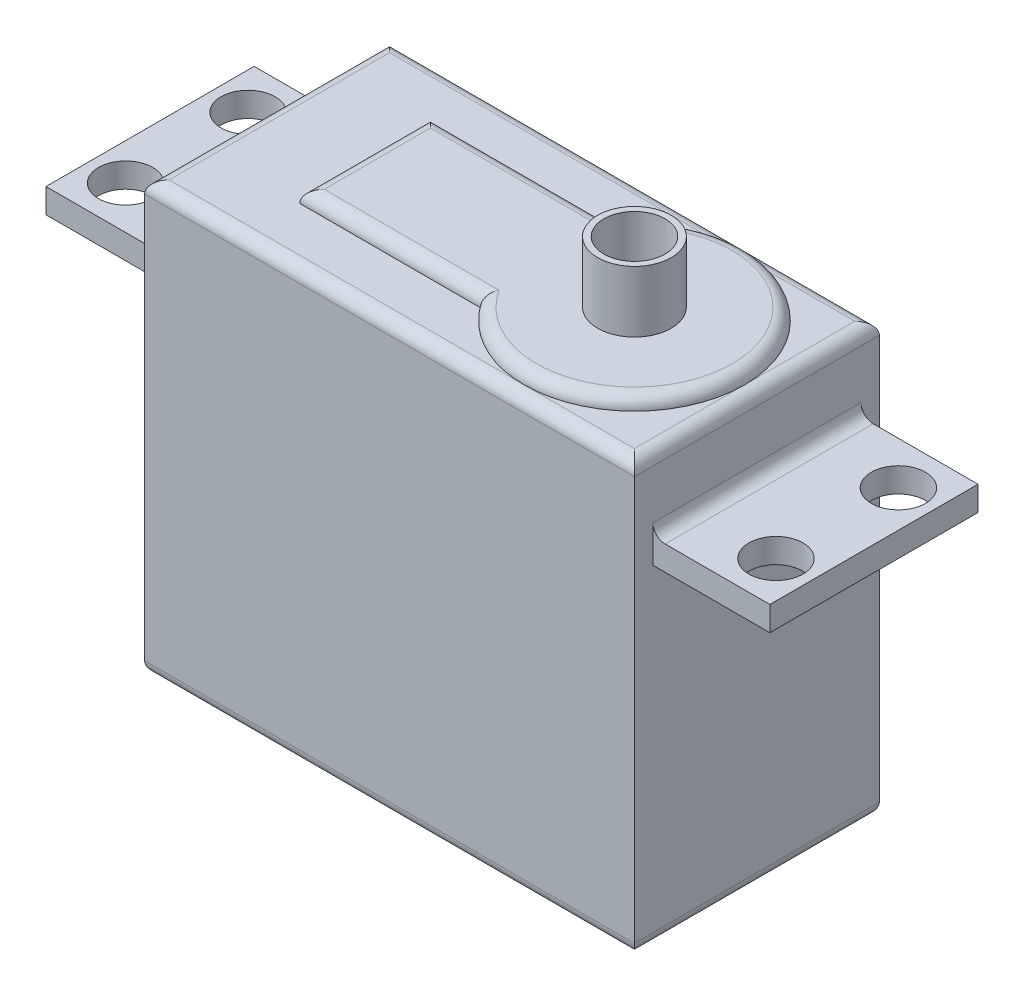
ISO-10303-21;
HEADER;
FILE_DESCRIPTION(('STEP AP214'),'2;1');
FILE_NAME('part.step','',(''),(''),'','','');
FILE_SCHEMA(('AUTOMOTIVE_DESIGN { 1 0 10303 214 1 1 1 1 }'));
ENDSEC;
DATA;
#1=APPLICATION_CONTEXT('core data for automotive mechanical design processes');
#2=APPLICATION_PROTOCOL_DEFINITION('international standard','automotive_design',2000,#1);
#3=PRODUCT_CONTEXT('',#1,'mechanical');
#4=PRODUCT('Part','Part','',(#3));
#5=PRODUCT_RELATED_PRODUCT_CATEGORY('part','',(#4));
#6=PRODUCT_DEFINITION_FORMATION('','',#4);
#7=PRODUCT_DEFINITION_CONTEXT('part definition',#1,'design');
#8=PRODUCT_DEFINITION('design','',#6,#7);
#9=PRODUCT_DEFINITION_SHAPE('','',#8);
#10=(LENGTH_UNIT() NAMED_UNIT(*) SI_UNIT(.MILLI.,.METRE.));
#11=(NAMED_UNIT(*) PLANE_ANGLE_UNIT() SI_UNIT($,.RADIAN.));
#12=(NAMED_UNIT(*) SI_UNIT($,.STERADIAN.) SOLID_ANGLE_UNIT());
#13=UNCERTAINTY_MEASURE_WITH_UNIT(LENGTH_MEASURE(1.E-05),#10,'distance_accuracy_value','');
#14=(GEOMETRIC_REPRESENTATION_CONTEXT(3) GLOBAL_UNCERTAINTY_ASSIGNED_CONTEXT((#13)) GLOBAL_UNIT_ASSIGNED_CONTEXT((#10,
#11,#12)) REPRESENTATION_CONTEXT('',''));
#15=CARTESIAN_POINT('',(0.,0.,0.));
#16=DIRECTION('',(0.,0.,1.));
#17=DIRECTION('',(1.,0.,0.));
#18=AXIS2_PLACEMENT_3D('',#15,#16,#17);
#19=CARTESIAN_POINT('',(-20.,17.5,20.));
#20=DIRECTION('',(0.,-1.,0.));
#21=DIRECTION('',(0.,0.,-1.));
#22=AXIS2_PLACEMENT_3D('',#19,#20,#21);
#23=PLANE('',#22);
#24=DIRECTION('',(1.,0.,0.));
#25=VECTOR('',#24,1.);
#26=CARTESIAN_POINT('',(0.,17.5,15.3325913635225));
#27=LINE('',#26,#25);
#28=CARTESIAN_POINT('',(-12.,17.5,15.3325913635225));
#29=VERTEX_POINT('',#28);
#30=CARTESIAN_POINT('',(2.74993314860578,17.5,15.3325913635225));
#31=VERTEX_POINT('',#30);
#32=EDGE_CURVE('E205',#29,#31,#27,.T.);
#33=ORIENTED_EDGE('',*,*,#32,.F.);
#34=DIRECTION('',(0.,0.,-1.));
#35=VECTOR('',#34,1.);
#36=CARTESIAN_POINT('',(-12.,17.5,0.));
#37=LINE('',#36,#35);
#38=CARTESIAN_POINT('',(-12.,17.5,4.66740863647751));
#39=VERTEX_POINT('',#38);
#40=EDGE_CURVE('E208',#29,#39,#37,.T.);
#41=ORIENTED_EDGE('',*,*,#40,.T.);
#42=DIRECTION('',(1.,0.,0.));
#43=VECTOR('',#42,1.);
#44=CARTESIAN_POINT('',(0.,17.5,4.66740863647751));
#45=LINE('',#44,#43);
#46=CARTESIAN_POINT('',(2.74993314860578,17.5,4.66740863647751));
#47=VERTEX_POINT('',#46);
#48=EDGE_CURVE('E235',#39,#47,#45,.T.);
#49=ORIENTED_EDGE('',*,*,#48,.T.);
#50=CARTESIAN_POINT('',(10.,17.5,10.));
#51=DIRECTION('',(0.,1.,0.));
#52=DIRECTION('',(0.,0.,1.));
#53=AXIS2_PLACEMENT_3D('',#50,#51,#52);
#54=CIRCLE('',#53,9.);
#55=CARTESIAN_POINT('',(10.,17.5,1.));
#56=VERTEX_POINT('',#55);
#57=EDGE_CURVE('E215',#56,#47,#54,.T.);
#58=ORIENTED_EDGE('',*,*,#57,.F.);
#59=DIRECTION('',(-1.,0.,0.));
#60=VECTOR('',#59,1.);
#61=CARTESIAN_POINT('',(-20.,17.5,1.));
#62=LINE('',#61,#60);
#63=CARTESIAN_POINT('',(-19.,17.5,1.));
#64=VERTEX_POINT('',#63);
#65=EDGE_CURVE('E368',#56,#64,#62,.T.);
#66=ORIENTED_EDGE('',*,*,#65,.T.);
#67=DIRECTION('',(0.,0.,-1.));
#68=VECTOR('',#67,1.);
#69=CARTESIAN_POINT('',(-19.,17.5,20.));
#70=LINE('',#69,#68);
#71=CARTESIAN_POINT('',(-19.,17.5,19.));
#72=VERTEX_POINT('',#71);
#73=EDGE_CURVE('E359',#64,#72,#70,.F.);
#74=ORIENTED_EDGE('',*,*,#73,.T.);
#75=DIRECTION('',(-1.,0.,0.));
#76=VECTOR('',#75,1.);
#77=CARTESIAN_POINT('',(20.,17.5,19.));
#78=LINE('',#77,#76);
#79=CARTESIAN_POINT('',(10.,17.5,19.));
#80=VERTEX_POINT('',#79);
#81=EDGE_CURVE('E362',#72,#80,#78,.F.);
#82=ORIENTED_EDGE('',*,*,#81,.T.);
#83=EDGE_CURVE('E211',#31,#80,#54,.T.);
#84=ORIENTED_EDGE('',*,*,#83,.F.);
#85=EDGE_LOOP('',(#33,#41,#49,#58,#66,#74,#82,#84));
#86=FACE_BOUND('',#85,.T.);
#87=ADVANCED_FACE('F41',(#86),#23,.F.);
#88=CARTESIAN_POINT('',(19.,17.5,10.));
#89=VERTEX_POINT('',#88);
#90=EDGE_CURVE('E236',#80,#89,#54,.T.);
#91=ORIENTED_EDGE('',*,*,#90,.F.);
#92=CARTESIAN_POINT('',(19.,17.5,19.));
#93=VERTEX_POINT('',#92);
#94=EDGE_CURVE('E361',#80,#93,#78,.F.);
#95=ORIENTED_EDGE('',*,*,#94,.T.);
#96=DIRECTION('',(0.,0.,-1.));
#97=VECTOR('',#96,1.);
#98=CARTESIAN_POINT('',(19.,17.5,20.));
#99=LINE('',#98,#97);
#100=EDGE_CURVE('E365',#93,#89,#99,.T.);
#101=ORIENTED_EDGE('',*,*,#100,.T.);
#102=EDGE_LOOP('',(#91,#95,#101));
#103=FACE_BOUND('',#102,.T.);
#104=ADVANCED_FACE('F441',(#103),#23,.F.);
#105=EDGE_CURVE('E460',#89,#56,#54,.T.);
#106=ORIENTED_EDGE('',*,*,#105,.F.);
#107=CARTESIAN_POINT('',(19.,17.5,1.));
#108=VERTEX_POINT('',#107);
#109=EDGE_CURVE('E364',#89,#108,#99,.T.);
#110=ORIENTED_EDGE('',*,*,#109,.T.);
#111=EDGE_CURVE('E369',#108,#56,#62,.T.);
#112=ORIENTED_EDGE('',*,*,#111,.T.);
#113=EDGE_LOOP('',(#106,#110,#112));
#114=FACE_BOUND('',#113,.T.);
#115=ADVANCED_FACE('F443',(#114),#23,.F.);
#116=CARTESIAN_POINT('',(-20.,17.5,20.));
#117=DIRECTION('',(1.,0.,0.));
#118=DIRECTION('',(0.,0.,-1.));
#119=AXIS2_PLACEMENT_3D('',#116,#117,#118);
#120=PLANE('',#119);
#121=DIRECTION('',(0.,-1.,0.));
#122=VECTOR('',#121,1.);
#123=CARTESIAN_POINT('',(-20.,17.5,0.));
#124=LINE('',#123,#122);
#125=CARTESIAN_POINT('',(-20.,16.5,0.));
#126=VERTEX_POINT('',#125);
#127=CARTESIAN_POINT('',(-20.,-16.5,0.));
#128=VERTEX_POINT('',#127);
#129=EDGE_CURVE('E323',#126,#128,#124,.T.);
#130=ORIENTED_EDGE('',*,*,#129,.T.);
#131=DIRECTION('',(0.,0.,-1.));
#132=VECTOR('',#131,1.);
#133=CARTESIAN_POINT('',(-20.,-16.5,20.));
#134=LINE('',#133,#132);
#135=CARTESIAN_POINT('',(-20.,-16.5,20.));
#136=VERTEX_POINT('',#135);
#137=EDGE_CURVE('E349',#128,#136,#134,.F.);
#138=ORIENTED_EDGE('',*,*,#137,.T.);
#139=DIRECTION('',(0.,-1.,0.));
#140=VECTOR('',#139,1.);
#141=CARTESIAN_POINT('',(-20.,17.5,20.));
#142=LINE('',#141,#140);
#143=CARTESIAN_POINT('',(-20.,16.5,20.));
#144=VERTEX_POINT('',#143);
#145=EDGE_CURVE('E322',#144,#136,#142,.T.);
#146=ORIENTED_EDGE('',*,*,#145,.F.);
#147=DIRECTION('',(0.,0.,-1.));
#148=VECTOR('',#147,1.);
#149=CARTESIAN_POINT('',(-20.,16.5,20.));
#150=LINE('',#149,#148);
#151=EDGE_CURVE('E347',#144,#126,#150,.T.);
#152=ORIENTED_EDGE('',*,*,#151,.T.);
#153=EDGE_LOOP('',(#130,#138,#146,#152));
#154=FACE_BOUND('',#153,.T.);
#155=DIRECTION('',(0.,-1.,0.));
#156=VECTOR('',#155,1.);
#157=CARTESIAN_POINT('',(-20.,11.5,1.5));
#158=LINE('',#157,#156);
#159=CARTESIAN_POINT('',(-20.,12.5,1.5));
#160=VERTEX_POINT('',#159);
#161=CARTESIAN_POINT('',(-20.,9.5,1.5));
#162=VERTEX_POINT('',#161);
#163=EDGE_CURVE('E243',#160,#162,#158,.T.);
#164=ORIENTED_EDGE('',*,*,#163,.F.);
#165=DIRECTION('',(0.,0.,-1.));
#166=VECTOR('',#165,1.);
#167=CARTESIAN_POINT('',(-20.,12.5,18.5));
#168=LINE('',#167,#166);
#169=CARTESIAN_POINT('',(-20.,12.5,18.5));
#170=VERTEX_POINT('',#169);
#171=EDGE_CURVE('E403',#160,#170,#168,.F.);
#172=ORIENTED_EDGE('',*,*,#171,.T.);
#173=DIRECTION('',(0.,-1.,0.));
#174=VECTOR('',#173,1.);
#175=CARTESIAN_POINT('',(-20.,11.5,18.5));
#176=LINE('',#175,#174);
#177=CARTESIAN_POINT('',(-20.,9.5,18.5));
#178=VERTEX_POINT('',#177);
#179=EDGE_CURVE('E241',#170,#178,#176,.T.);
#180=ORIENTED_EDGE('',*,*,#179,.T.);
#181=DIRECTION('',(0.,0.,-1.));
#182=VECTOR('',#181,1.);
#183=CARTESIAN_POINT('',(-20.,9.5,18.5));
#184=LINE('',#183,#182);
#185=EDGE_CURVE('E252',#178,#162,#184,.T.);
#186=ORIENTED_EDGE('',*,*,#185,.T.);
#187=EDGE_LOOP('',(#164,#172,#180,#186));
#188=FACE_BOUND('',#187,.T.);
#189=ADVANCED_FACE('F452',(#154,#188),#120,.F.);
#190=CARTESIAN_POINT('',(20.,17.5,20.));
#191=DIRECTION('',(-1.,0.,0.));
#192=DIRECTION('',(0.,0.,1.));
#193=AXIS2_PLACEMENT_3D('',#190,#191,#192);
#194=PLANE('',#193);
#195=DIRECTION('',(0.,1.,0.));
#196=VECTOR('',#195,1.);
#197=CARTESIAN_POINT('',(20.,17.5,20.));
#198=LINE('',#197,#196);
#199=CARTESIAN_POINT('',(20.,-16.5,20.));
#200=VERTEX_POINT('',#199);
#201=CARTESIAN_POINT('',(20.,16.5,20.));
#202=VERTEX_POINT('',#201);
#203=EDGE_CURVE('E319',#200,#202,#198,.T.);
#204=ORIENTED_EDGE('',*,*,#203,.F.);
#205=DIRECTION('',(0.,0.,-1.));
#206=VECTOR('',#205,1.);
#207=CARTESIAN_POINT('',(20.,-16.5,20.));
#208=LINE('',#207,#206);
#209=CARTESIAN_POINT('',(20.,-16.5,0.));
#210=VERTEX_POINT('',#209);
#211=EDGE_CURVE('E353',#200,#210,#208,.T.);
#212=ORIENTED_EDGE('',*,*,#211,.T.);
#213=DIRECTION('',(0.,1.,0.));
#214=VECTOR('',#213,1.);
#215=CARTESIAN_POINT('',(20.,17.5,0.));
#216=LINE('',#215,#214);
#217=CARTESIAN_POINT('',(20.,16.5,0.));
#218=VERTEX_POINT('',#217);
#219=EDGE_CURVE('E327',#210,#218,#216,.T.);
#220=ORIENTED_EDGE('',*,*,#219,.T.);
#221=DIRECTION('',(0.,0.,-1.));
#222=VECTOR('',#221,1.);
#223=CARTESIAN_POINT('',(20.,16.5,20.));
#224=LINE('',#223,#222);
#225=EDGE_CURVE('E351',#218,#202,#224,.F.);
#226=ORIENTED_EDGE('',*,*,#225,.T.);
#227=EDGE_LOOP('',(#204,#212,#220,#226));
#228=FACE_BOUND('',#227,.T.);
#229=DIRECTION('',(0.,-1.,0.));
#230=VECTOR('',#229,1.);
#231=CARTESIAN_POINT('',(20.,11.5,18.5));
#232=LINE('',#231,#230);
#233=CARTESIAN_POINT('',(20.,12.5,18.5));
#234=VERTEX_POINT('',#233);
#235=CARTESIAN_POINT('',(20.,9.5,18.5));
#236=VERTEX_POINT('',#235);
#237=EDGE_CURVE('E315',#234,#236,#232,.T.);
#238=ORIENTED_EDGE('',*,*,#237,.F.);
#239=DIRECTION('',(0.,0.,1.));
#240=VECTOR('',#239,1.);
#241=CARTESIAN_POINT('',(20.,12.5,20.));
#242=LINE('',#241,#240);
#243=CARTESIAN_POINT('',(20.,12.5,1.5));
#244=VERTEX_POINT('',#243);
#245=EDGE_CURVE('E397',#234,#244,#242,.F.);
#246=ORIENTED_EDGE('',*,*,#245,.T.);
#247=DIRECTION('',(0.,-1.,0.));
#248=VECTOR('',#247,1.);
#249=CARTESIAN_POINT('',(20.,11.5,1.5));
#250=LINE('',#249,#248);
#251=CARTESIAN_POINT('',(20.,9.5,1.5));
#252=VERTEX_POINT('',#251);
#253=EDGE_CURVE('E300',#244,#252,#250,.T.);
#254=ORIENTED_EDGE('',*,*,#253,.T.);
#255=DIRECTION('',(0.,0.,1.));
#256=VECTOR('',#255,1.);
#257=CARTESIAN_POINT('',(20.,9.5,18.5));
#258=LINE('',#257,#256);
#259=EDGE_CURVE('E289',#252,#236,#258,.T.);
#260=ORIENTED_EDGE('',*,*,#259,.T.);
#261=EDGE_LOOP('',(#238,#246,#254,#260));
#262=FACE_BOUND('',#261,.T.);
#263=ADVANCED_FACE('F457',(#228,#262),#194,.F.);
#264=CARTESIAN_POINT('',(-20.,-17.5,20.));
#265=DIRECTION('',(0.,1.,0.));
#266=DIRECTION('',(0.,0.,1.));
#267=AXIS2_PLACEMENT_3D('',#264,#265,#266);
#268=PLANE('',#267);
#269=DIRECTION('',(0.,0.,-1.));
#270=VECTOR('',#269,1.);
#271=CARTESIAN_POINT('',(-19.,-17.5,20.));
#272=LINE('',#271,#270);
#273=CARTESIAN_POINT('',(-19.,-17.5,19.));
#274=VERTEX_POINT('',#273);
#275=CARTESIAN_POINT('',(-19.,-17.5,1.));
#276=VERTEX_POINT('',#275);
#277=EDGE_CURVE('E336',#274,#276,#272,.T.);
#278=ORIENTED_EDGE('',*,*,#277,.T.);
#279=DIRECTION('',(1.,0.,0.));
#280=VECTOR('',#279,1.);
#281=CARTESIAN_POINT('',(-20.,-17.5,1.));
#282=LINE('',#281,#280);
#283=CARTESIAN_POINT('',(19.,-17.5,1.));
#284=VERTEX_POINT('',#283);
#285=EDGE_CURVE('E338',#276,#284,#282,.T.);
#286=ORIENTED_EDGE('',*,*,#285,.T.);
#287=DIRECTION('',(0.,0.,-1.));
#288=VECTOR('',#287,1.);
#289=CARTESIAN_POINT('',(19.,-17.5,20.));
#290=LINE('',#289,#288);
#291=CARTESIAN_POINT('',(19.,-17.5,19.));
#292=VERTEX_POINT('',#291);
#293=EDGE_CURVE('E334',#284,#292,#290,.F.);
#294=ORIENTED_EDGE('',*,*,#293,.T.);
#295=DIRECTION('',(1.,0.,0.));
#296=VECTOR('',#295,1.);
#297=CARTESIAN_POINT('',(-20.,-17.5,19.));
#298=LINE('',#297,#296);
#299=EDGE_CURVE('E326',#292,#274,#298,.F.);
#300=ORIENTED_EDGE('',*,*,#299,.T.);
#301=EDGE_LOOP('',(#278,#286,#294,#300));
#302=FACE_BOUND('',#301,.T.);
#303=ADVANCED_FACE('F671',(#302),#268,.F.);
#304=CARTESIAN_POINT('',(0.,0.,20.));
#305=DIRECTION('',(0.,0.,1.));
#306=DIRECTION('',(1.,0.,0.));
#307=AXIS2_PLACEMENT_3D('',#304,#305,#306);
#308=PLANE('',#307);
#309=ORIENTED_EDGE('',*,*,#145,.T.);
#310=DIRECTION('',(1.,0.,0.));
#311=VECTOR('',#310,1.);
#312=CARTESIAN_POINT('',(20.,-16.5,20.));
#313=LINE('',#312,#311);
#314=EDGE_CURVE('E357',#136,#200,#313,.T.);
#315=ORIENTED_EDGE('',*,*,#314,.T.);
#316=ORIENTED_EDGE('',*,*,#203,.T.);
#317=DIRECTION('',(-1.,0.,0.));
#318=VECTOR('',#317,1.);
#319=CARTESIAN_POINT('',(-20.,16.5,20.));
#320=LINE('',#319,#318);
#321=EDGE_CURVE('E355',#202,#144,#320,.T.);
#322=ORIENTED_EDGE('',*,*,#321,.T.);
#323=EDGE_LOOP('',(#309,#315,#316,#322));
#324=FACE_BOUND('',#323,.T.);
#325=ADVANCED_FACE('F662',(#324),#308,.T.);
#326=CARTESIAN_POINT('',(0.,0.,0.));
#327=DIRECTION('',(0.,0.,1.));
#328=DIRECTION('',(1.,0.,0.));
#329=AXIS2_PLACEMENT_3D('',#326,#327,#328);
#330=PLANE('',#329);
#331=ORIENTED_EDGE('',*,*,#219,.F.);
#332=DIRECTION('',(1.,0.,0.));
#333=VECTOR('',#332,1.);
#334=CARTESIAN_POINT('',(0.,-16.5,0.));
#335=LINE('',#334,#333);
#336=EDGE_CURVE('E344',#210,#128,#335,.F.);
#337=ORIENTED_EDGE('',*,*,#336,.T.);
#338=ORIENTED_EDGE('',*,*,#129,.F.);
#339=DIRECTION('',(-1.,0.,0.));
#340=VECTOR('',#339,1.);
#341=CARTESIAN_POINT('',(0.,16.5,0.));
#342=LINE('',#341,#340);
#343=EDGE_CURVE('E341',#126,#218,#342,.F.);
#344=ORIENTED_EDGE('',*,*,#343,.T.);
#345=EDGE_LOOP('',(#331,#337,#338,#344));
#346=FACE_BOUND('',#345,.T.);
#347=ADVANCED_FACE('F653',(#346),#330,.F.);
#348=CARTESIAN_POINT('',(0.,-16.5,19.));
#349=DIRECTION('',(-1.,0.,0.));
#350=DIRECTION('',(0.,0.,1.));
#351=AXIS2_PLACEMENT_3D('',#348,#349,#350);
#352=CYLINDRICAL_SURFACE('',#351,1.);
#353=CARTESIAN_POINT('',(19.,-16.5,19.));
#354=DIRECTION('',(-0.707106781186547,0.,0.707106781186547));
#355=DIRECTION('',(-0.707106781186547,0.,-0.707106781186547));
#356=AXIS2_PLACEMENT_3D('',#353,#354,#355);
#357=ELLIPSE('',#356,1.41421356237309,1.);
#358=EDGE_CURVE('E378',#200,#292,#357,.F.);
#359=ORIENTED_EDGE('',*,*,#358,.F.);
#360=ORIENTED_EDGE('',*,*,#314,.F.);
#361=CARTESIAN_POINT('',(-19.,-16.5,19.));
#362=DIRECTION('',(-0.707106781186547,0.,-0.707106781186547));
#363=DIRECTION('',(-0.707106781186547,0.,0.707106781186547));
#364=AXIS2_PLACEMENT_3D('',#361,#362,#363);
#365=ELLIPSE('',#364,1.41421356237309,1.);
#366=EDGE_CURVE('E330',#274,#136,#365,.T.);
#367=ORIENTED_EDGE('',*,*,#366,.F.);
#368=ORIENTED_EDGE('',*,*,#299,.F.);
#369=EDGE_LOOP('',(#359,#360,#367,#368));
#370=FACE_BOUND('',#369,.T.);
#371=ADVANCED_FACE('F644',(#370),#352,.T.);
#372=CARTESIAN_POINT('',(-19.,-16.5,20.));
#373=DIRECTION('',(0.,0.,-1.));
#374=DIRECTION('',(-1.,0.,0.));
#375=AXIS2_PLACEMENT_3D('',#372,#373,#374);
#376=CYLINDRICAL_SURFACE('',#375,1.);
#377=ORIENTED_EDGE('',*,*,#366,.T.);
#378=ORIENTED_EDGE('',*,*,#137,.F.);
#379=CARTESIAN_POINT('',(-19.,-16.5,1.));
#380=DIRECTION('',(0.707106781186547,0.,-0.707106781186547));
#381=DIRECTION('',(-0.707106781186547,0.,-0.707106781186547));
#382=AXIS2_PLACEMENT_3D('',#379,#380,#381);
#383=ELLIPSE('',#382,1.41421356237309,1.);
#384=EDGE_CURVE('E375',#276,#128,#383,.T.);
#385=ORIENTED_EDGE('',*,*,#384,.F.);
#386=ORIENTED_EDGE('',*,*,#277,.F.);
#387=EDGE_LOOP('',(#377,#378,#385,#386));
#388=FACE_BOUND('',#387,.T.);
#389=ADVANCED_FACE('F635',(#388),#376,.T.);
#390=CARTESIAN_POINT('',(19.,-16.5,20.));
#391=DIRECTION('',(0.,0.,-1.));
#392=DIRECTION('',(-1.,0.,0.));
#393=AXIS2_PLACEMENT_3D('',#390,#391,#392);
#394=CYLINDRICAL_SURFACE('',#393,1.);
#395=ORIENTED_EDGE('',*,*,#358,.T.);
#396=ORIENTED_EDGE('',*,*,#293,.F.);
#397=CARTESIAN_POINT('',(19.,-16.5,1.));
#398=DIRECTION('',(-0.707106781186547,0.,-0.707106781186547));
#399=DIRECTION('',(0.707106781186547,0.,-0.707106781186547));
#400=AXIS2_PLACEMENT_3D('',#397,#398,#399);
#401=ELLIPSE('',#400,1.41421356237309,1.);
#402=EDGE_CURVE('E373',#210,#284,#401,.T.);
#403=ORIENTED_EDGE('',*,*,#402,.F.);
#404=ORIENTED_EDGE('',*,*,#211,.F.);
#405=EDGE_LOOP('',(#395,#396,#403,#404));
#406=FACE_BOUND('',#405,.T.);
#407=ADVANCED_FACE('F625',(#406),#394,.T.);
#408=CARTESIAN_POINT('',(-20.,-16.5,1.));
#409=DIRECTION('',(1.,0.,0.));
#410=DIRECTION('',(0.,0.,-1.));
#411=AXIS2_PLACEMENT_3D('',#408,#409,#410);
#412=CYLINDRICAL_SURFACE('',#411,1.);
#413=ORIENTED_EDGE('',*,*,#384,.T.);
#414=ORIENTED_EDGE('',*,*,#336,.F.);
#415=ORIENTED_EDGE('',*,*,#402,.T.);
#416=ORIENTED_EDGE('',*,*,#285,.F.);
#417=EDGE_LOOP('',(#413,#414,#415,#416));
#418=FACE_BOUND('',#417,.T.);
#419=ADVANCED_FACE('F620',(#418),#412,.T.);
#420=CARTESIAN_POINT('',(0.,16.5,19.));
#421=DIRECTION('',(1.,0.,0.));
#422=DIRECTION('',(0.,0.,-1.));
#423=AXIS2_PLACEMENT_3D('',#420,#421,#422);
#424=CYLINDRICAL_SURFACE('',#423,1.);
#425=CARTESIAN_POINT('',(-19.,16.5,19.));
#426=DIRECTION('',(-0.707106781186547,0.,-0.707106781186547));
#427=DIRECTION('',(0.707106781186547,0.,-0.707106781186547));
#428=AXIS2_PLACEMENT_3D('',#425,#426,#427);
#429=ELLIPSE('',#428,1.41421356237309,1.);
#430=EDGE_CURVE('E387',#144,#72,#429,.T.);
#431=ORIENTED_EDGE('',*,*,#430,.F.);
#432=ORIENTED_EDGE('',*,*,#321,.F.);
#433=CARTESIAN_POINT('',(19.,16.5,19.));
#434=DIRECTION('',(0.707106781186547,0.,-0.707106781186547));
#435=DIRECTION('',(0.707106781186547,0.,0.707106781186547));
#436=AXIS2_PLACEMENT_3D('',#433,#434,#435);
#437=ELLIPSE('',#436,1.41421356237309,1.);
#438=EDGE_CURVE('E376',#93,#202,#437,.T.);
#439=ORIENTED_EDGE('',*,*,#438,.F.);
#440=ORIENTED_EDGE('',*,*,#94,.F.);
#441=ORIENTED_EDGE('',*,*,#81,.F.);
#442=EDGE_LOOP('',(#431,#432,#439,#440,#441));
#443=FACE_BOUND('',#442,.T.);
#444=ADVANCED_FACE('F624',(#443),#424,.T.);
#445=CARTESIAN_POINT('',(19.,16.5,20.));
#446=DIRECTION('',(0.,0.,-1.));
#447=DIRECTION('',(-1.,0.,0.));
#448=AXIS2_PLACEMENT_3D('',#445,#446,#447);
#449=CYLINDRICAL_SURFACE('',#448,1.);
#450=ORIENTED_EDGE('',*,*,#438,.T.);
#451=ORIENTED_EDGE('',*,*,#225,.F.);
#452=CARTESIAN_POINT('',(19.,16.5,1.));
#453=DIRECTION('',(-0.707106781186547,0.,-0.707106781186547));
#454=DIRECTION('',(0.707106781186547,0.,-0.707106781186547));
#455=AXIS2_PLACEMENT_3D('',#452,#453,#454);
#456=ELLIPSE('',#455,1.41421356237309,1.);
#457=EDGE_CURVE('E385',#108,#218,#456,.T.);
#458=ORIENTED_EDGE('',*,*,#457,.F.);
#459=ORIENTED_EDGE('',*,*,#109,.F.);
#460=ORIENTED_EDGE('',*,*,#100,.F.);
#461=EDGE_LOOP('',(#450,#451,#458,#459,#460));
#462=FACE_BOUND('',#461,.T.);
#463=ADVANCED_FACE('F468',(#462),#449,.T.);
#464=CARTESIAN_POINT('',(-19.,16.5,20.));
#465=DIRECTION('',(0.,0.,-1.));
#466=DIRECTION('',(-1.,0.,0.));
#467=AXIS2_PLACEMENT_3D('',#464,#465,#466);
#468=CYLINDRICAL_SURFACE('',#467,1.);
#469=ORIENTED_EDGE('',*,*,#430,.T.);
#470=ORIENTED_EDGE('',*,*,#73,.F.);
#471=CARTESIAN_POINT('',(-19.,16.5,1.));
#472=DIRECTION('',(0.707106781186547,0.,-0.707106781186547));
#473=DIRECTION('',(-0.707106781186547,0.,-0.707106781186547));
#474=AXIS2_PLACEMENT_3D('',#471,#472,#473);
#475=ELLIPSE('',#474,1.41421356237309,1.);
#476=EDGE_CURVE('E318',#126,#64,#475,.T.);
#477=ORIENTED_EDGE('',*,*,#476,.F.);
#478=ORIENTED_EDGE('',*,*,#151,.F.);
#479=EDGE_LOOP('',(#469,#470,#477,#478));
#480=FACE_BOUND('',#479,.T.);
#481=ADVANCED_FACE('F608',(#480),#468,.T.);
#482=CARTESIAN_POINT('',(-20.,16.5,1.));
#483=DIRECTION('',(-1.,0.,0.));
#484=DIRECTION('',(0.,0.,1.));
#485=AXIS2_PLACEMENT_3D('',#482,#483,#484);
#486=CYLINDRICAL_SURFACE('',#485,1.);
#487=ORIENTED_EDGE('',*,*,#457,.T.);
#488=ORIENTED_EDGE('',*,*,#343,.F.);
#489=ORIENTED_EDGE('',*,*,#476,.T.);
#490=ORIENTED_EDGE('',*,*,#65,.F.);
#491=ORIENTED_EDGE('',*,*,#111,.F.);
#492=EDGE_LOOP('',(#487,#488,#489,#490,#491));
#493=FACE_BOUND('',#492,.T.);
#494=ADVANCED_FACE('F612',(#493),#486,.T.);
#495=CARTESIAN_POINT('',(0.,11.5,0.));
#496=DIRECTION('',(0.,1.,0.));
#497=DIRECTION('',(0.,0.,1.));
#498=AXIS2_PLACEMENT_3D('',#495,#496,#497);
#499=PLANE('',#498);
#500=CARTESIAN_POINT('',(26.5561502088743,11.5,4.99999999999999));
#501=DIRECTION('',(0.,1.,0.));
#502=DIRECTION('',(0.,0.,1.));
#503=AXIS2_PLACEMENT_3D('',#500,#501,#502);
#504=CIRCLE('',#503,2.20951766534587);
#505=CARTESIAN_POINT('',(26.5561502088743,11.5,7.20951766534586));
#506=VERTEX_POINT('',#505);
#507=EDGE_CURVE('E286',#506,#506,#504,.T.);
#508=ORIENTED_EDGE('',*,*,#507,.F.);
#509=EDGE_LOOP('',(#508));
#510=FACE_BOUND('',#509,.T.);
#511=DIRECTION('',(-1.,0.,0.));
#512=VECTOR('',#511,1.);
#513=CARTESIAN_POINT('',(29.5561502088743,11.5,1.5));
#514=LINE('',#513,#512);
#515=CARTESIAN_POINT('',(29.5561502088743,11.5,1.5));
#516=VERTEX_POINT('',#515);
#517=CARTESIAN_POINT('',(21.,11.5,1.5));
#518=VERTEX_POINT('',#517);
#519=EDGE_CURVE('E297',#516,#518,#514,.T.);
#520=ORIENTED_EDGE('',*,*,#519,.T.);
#521=DIRECTION('',(0.,0.,1.));
#522=VECTOR('',#521,1.);
#523=CARTESIAN_POINT('',(21.,11.5,0.));
#524=LINE('',#523,#522);
#525=CARTESIAN_POINT('',(21.,11.5,18.5));
#526=VERTEX_POINT('',#525);
#527=EDGE_CURVE('E394',#518,#526,#524,.T.);
#528=ORIENTED_EDGE('',*,*,#527,.T.);
#529=DIRECTION('',(1.,0.,0.));
#530=VECTOR('',#529,1.);
#531=CARTESIAN_POINT('',(29.5561502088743,11.5,18.5));
#532=LINE('',#531,#530);
#533=CARTESIAN_POINT('',(29.5561502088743,11.5,18.5));
#534=VERTEX_POINT('',#533);
#535=EDGE_CURVE('E292',#526,#534,#532,.T.);
#536=ORIENTED_EDGE('',*,*,#535,.T.);
#537=DIRECTION('',(0.,0.,-1.));
#538=VECTOR('',#537,1.);
#539=CARTESIAN_POINT('',(29.5561502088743,11.5,18.5));
#540=LINE('',#539,#538);
#541=EDGE_CURVE('E294',#534,#516,#540,.T.);
#542=ORIENTED_EDGE('',*,*,#541,.T.);
#543=EDGE_LOOP('',(#520,#528,#536,#542));
#544=FACE_BOUND('',#543,.T.);
#545=CARTESIAN_POINT('',(26.5561502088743,11.5,15.));
#546=DIRECTION('',(0.,1.,0.));
#547=DIRECTION('',(0.,0.,-1.));
#548=AXIS2_PLACEMENT_3D('',#545,#546,#547);
#549=CIRCLE('',#548,2.20951766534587);
#550=CARTESIAN_POINT('',(26.5561502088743,11.5,12.7904823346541));
#551=VERTEX_POINT('',#550);
#552=EDGE_CURVE('E280',#551,#551,#549,.T.);
#553=ORIENTED_EDGE('',*,*,#552,.F.);
#554=EDGE_LOOP('',(#553));
#555=FACE_BOUND('',#554,.T.);
#556=ADVANCED_FACE('F601',(#510,#544,#555),#499,.T.);
#557=CARTESIAN_POINT('',(0.,9.5,0.));
#558=DIRECTION('',(0.,1.,0.));
#559=DIRECTION('',(0.,0.,1.));
#560=AXIS2_PLACEMENT_3D('',#557,#558,#559);
#561=PLANE('',#560);
#562=ORIENTED_EDGE('',*,*,#259,.F.);
#563=DIRECTION('',(-1.,0.,0.));
#564=VECTOR('',#563,1.);
#565=CARTESIAN_POINT('',(29.5561502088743,9.5,1.5));
#566=LINE('',#565,#564);
#567=CARTESIAN_POINT('',(29.5561502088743,9.5,1.5));
#568=VERTEX_POINT('',#567);
#569=EDGE_CURVE('E295',#568,#252,#566,.T.);
#570=ORIENTED_EDGE('',*,*,#569,.F.);
#571=DIRECTION('',(0.,0.,-1.));
#572=VECTOR('',#571,1.);
#573=CARTESIAN_POINT('',(29.5561502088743,9.5,18.5));
#574=LINE('',#573,#572);
#575=CARTESIAN_POINT('',(29.5561502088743,9.5,18.5));
#576=VERTEX_POINT('',#575);
#577=EDGE_CURVE('E304',#576,#568,#574,.T.);
#578=ORIENTED_EDGE('',*,*,#577,.F.);
#579=DIRECTION('',(1.,0.,0.));
#580=VECTOR('',#579,1.);
#581=CARTESIAN_POINT('',(29.5561502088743,9.5,18.5));
#582=LINE('',#581,#580);
#583=EDGE_CURVE('E302',#236,#576,#582,.T.);
#584=ORIENTED_EDGE('',*,*,#583,.F.);
#585=EDGE_LOOP('',(#562,#570,#578,#584));
#586=FACE_BOUND('',#585,.T.);
#587=CARTESIAN_POINT('',(26.5561502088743,9.5,4.99999999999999));
#588=DIRECTION('',(0.,1.,0.));
#589=DIRECTION('',(0.,0.,1.));
#590=AXIS2_PLACEMENT_3D('',#587,#588,#589);
#591=CIRCLE('',#590,2.20951766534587);
#592=CARTESIAN_POINT('',(26.5561502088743,9.5,7.20951766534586));
#593=VERTEX_POINT('',#592);
#594=EDGE_CURVE('E283',#593,#593,#591,.T.);
#595=ORIENTED_EDGE('',*,*,#594,.T.);
#596=EDGE_LOOP('',(#595));
#597=FACE_BOUND('',#596,.T.);
#598=CARTESIAN_POINT('',(26.5561502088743,9.5,15.));
#599=DIRECTION('',(0.,1.,0.));
#600=DIRECTION('',(0.,0.,-1.));
#601=AXIS2_PLACEMENT_3D('',#598,#599,#600);
#602=CIRCLE('',#601,2.20951766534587);
#603=CARTESIAN_POINT('',(26.5561502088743,9.5,12.7904823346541));
#604=VERTEX_POINT('',#603);
#605=EDGE_CURVE('E277',#604,#604,#602,.T.);
#606=ORIENTED_EDGE('',*,*,#605,.T.);
#607=EDGE_LOOP('',(#606));
#608=FACE_BOUND('',#607,.T.);
#609=ADVANCED_FACE('F597',(#586,#597,#608),#561,.F.);
#610=CARTESIAN_POINT('',(29.5561502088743,11.5,18.5));
#611=DIRECTION('',(0.,0.,-1.));
#612=DIRECTION('',(-1.,0.,0.));
#613=AXIS2_PLACEMENT_3D('',#610,#611,#612);
#614=PLANE('',#613);
#615=ORIENTED_EDGE('',*,*,#583,.T.);
#616=DIRECTION('',(0.,-1.,0.));
#617=VECTOR('',#616,1.);
#618=CARTESIAN_POINT('',(29.5561502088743,11.5,18.5));
#619=LINE('',#618,#617);
#620=EDGE_CURVE('E312',#534,#576,#619,.T.);
#621=ORIENTED_EDGE('',*,*,#620,.F.);
#622=ORIENTED_EDGE('',*,*,#535,.F.);
#623=CARTESIAN_POINT('',(21.,12.5,18.5));
#624=DIRECTION('',(0.,0.,-1.));
#625=DIRECTION('',(-1.,0.,0.));
#626=AXIS2_PLACEMENT_3D('',#623,#624,#625);
#627=CIRCLE('',#626,1.);
#628=EDGE_CURVE('E411',#526,#234,#627,.T.);
#629=ORIENTED_EDGE('',*,*,#628,.T.);
#630=ORIENTED_EDGE('',*,*,#237,.T.);
#631=EDGE_LOOP('',(#615,#621,#622,#629,#630));
#632=FACE_BOUND('',#631,.T.);
#633=ADVANCED_FACE('F590',(#632),#614,.F.);
#634=CARTESIAN_POINT('',(29.5561502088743,11.5,18.5));
#635=DIRECTION('',(-1.,0.,0.));
#636=DIRECTION('',(0.,0.,1.));
#637=AXIS2_PLACEMENT_3D('',#634,#635,#636);
#638=PLANE('',#637);
#639=ORIENTED_EDGE('',*,*,#577,.T.);
#640=DIRECTION('',(0.,-1.,0.));
#641=VECTOR('',#640,1.);
#642=CARTESIAN_POINT('',(29.5561502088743,11.5,1.5));
#643=LINE('',#642,#641);
#644=EDGE_CURVE('E309',#516,#568,#643,.T.);
#645=ORIENTED_EDGE('',*,*,#644,.F.);
#646=ORIENTED_EDGE('',*,*,#541,.F.);
#647=ORIENTED_EDGE('',*,*,#620,.T.);
#648=EDGE_LOOP('',(#639,#645,#646,#647));
#649=FACE_BOUND('',#648,.T.);
#650=ADVANCED_FACE('F586',(#649),#638,.F.);
#651=CARTESIAN_POINT('',(29.5561502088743,11.5,1.5));
#652=DIRECTION('',(0.,0.,1.));
#653=DIRECTION('',(1.,0.,0.));
#654=AXIS2_PLACEMENT_3D('',#651,#652,#653);
#655=PLANE('',#654);
#656=ORIENTED_EDGE('',*,*,#569,.T.);
#657=ORIENTED_EDGE('',*,*,#253,.F.);
#658=CARTESIAN_POINT('',(21.,12.5,1.5));
#659=DIRECTION('',(0.,0.,1.));
#660=DIRECTION('',(1.,0.,0.));
#661=AXIS2_PLACEMENT_3D('',#658,#659,#660);
#662=CIRCLE('',#661,1.);
#663=EDGE_CURVE('E414',#244,#518,#662,.T.);
#664=ORIENTED_EDGE('',*,*,#663,.T.);
#665=ORIENTED_EDGE('',*,*,#519,.F.);
#666=ORIENTED_EDGE('',*,*,#644,.T.);
#667=EDGE_LOOP('',(#656,#657,#664,#665,#666));
#668=FACE_BOUND('',#667,.T.);
#669=ADVANCED_FACE('F579',(#668),#655,.F.);
#670=CARTESIAN_POINT('',(26.5561502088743,11.5,4.99999999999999));
#671=DIRECTION('',(0.,-1.,0.));
#672=DIRECTION('',(0.,0.,-1.));
#673=AXIS2_PLACEMENT_3D('',#670,#671,#672);
#674=CYLINDRICAL_SURFACE('',#673,2.20951766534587);
#675=ORIENTED_EDGE('',*,*,#507,.T.);
#676=EDGE_LOOP('',(#675));
#677=FACE_BOUND('',#676,.T.);
#678=ORIENTED_EDGE('',*,*,#594,.F.);
#679=EDGE_LOOP('',(#678));
#680=FACE_BOUND('',#679,.T.);
#681=ADVANCED_FACE('F570',(#677,#680),#674,.F.);
#682=CARTESIAN_POINT('',(26.5561502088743,11.5,15.));
#683=DIRECTION('',(0.,-1.,0.));
#684=DIRECTION('',(0.,0.,-1.));
#685=AXIS2_PLACEMENT_3D('',#682,#683,#684);
#686=CYLINDRICAL_SURFACE('',#685,2.20951766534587);
#687=ORIENTED_EDGE('',*,*,#552,.T.);
#688=EDGE_LOOP('',(#687));
#689=FACE_BOUND('',#688,.T.);
#690=ORIENTED_EDGE('',*,*,#605,.F.);
#691=EDGE_LOOP('',(#690));
#692=FACE_BOUND('',#691,.T.);
#693=ADVANCED_FACE('F566',(#689,#692),#686,.F.);
#694=CARTESIAN_POINT('',(0.,11.5,0.));
#695=DIRECTION('',(0.,-1.,0.));
#696=DIRECTION('',(0.,0.,-1.));
#697=AXIS2_PLACEMENT_3D('',#694,#695,#696);
#698=PLANE('',#697);
#699=DIRECTION('',(1.,0.,0.));
#700=VECTOR('',#699,1.);
#701=CARTESIAN_POINT('',(-29.5561502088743,11.5,18.5));
#702=LINE('',#701,#700);
#703=CARTESIAN_POINT('',(-29.5561502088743,11.5,18.5));
#704=VERTEX_POINT('',#703);
#705=CARTESIAN_POINT('',(-21.,11.5,18.5));
#706=VERTEX_POINT('',#705);
#707=EDGE_CURVE('E263',#704,#706,#702,.T.);
#708=ORIENTED_EDGE('',*,*,#707,.T.);
#709=DIRECTION('',(0.,0.,-1.));
#710=VECTOR('',#709,1.);
#711=CARTESIAN_POINT('',(-21.,11.5,1.5));
#712=LINE('',#711,#710);
#713=CARTESIAN_POINT('',(-21.,11.5,1.5));
#714=VERTEX_POINT('',#713);
#715=EDGE_CURVE('E400',#706,#714,#712,.T.);
#716=ORIENTED_EDGE('',*,*,#715,.T.);
#717=DIRECTION('',(-1.,0.,0.));
#718=VECTOR('',#717,1.);
#719=CARTESIAN_POINT('',(-29.5561502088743,11.5,1.5));
#720=LINE('',#719,#718);
#721=CARTESIAN_POINT('',(-29.5561502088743,11.5,1.5));
#722=VERTEX_POINT('',#721);
#723=EDGE_CURVE('E249',#714,#722,#720,.T.);
#724=ORIENTED_EDGE('',*,*,#723,.T.);
#725=DIRECTION('',(0.,0.,1.));
#726=VECTOR('',#725,1.);
#727=CARTESIAN_POINT('',(-29.5561502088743,11.5,18.5));
#728=LINE('',#727,#726);
#729=EDGE_CURVE('E253',#722,#704,#728,.T.);
#730=ORIENTED_EDGE('',*,*,#729,.T.);
#731=EDGE_LOOP('',(#708,#716,#724,#730));
#732=FACE_BOUND('',#731,.T.);
#733=CARTESIAN_POINT('',(-26.5561502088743,11.5,5.));
#734=DIRECTION('',(0.,1.,0.));
#735=DIRECTION('',(0.,0.,-1.));
#736=AXIS2_PLACEMENT_3D('',#733,#734,#735);
#737=CIRCLE('',#736,2.20951766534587);
#738=CARTESIAN_POINT('',(-26.5561502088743,11.5,2.79048233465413));
#739=VERTEX_POINT('',#738);
#740=EDGE_CURVE('E261',#739,#739,#737,.T.);
#741=ORIENTED_EDGE('',*,*,#740,.F.);
#742=EDGE_LOOP('',(#741));
#743=FACE_BOUND('',#742,.T.);
#744=CARTESIAN_POINT('',(-26.5561502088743,11.5,15.));
#745=DIRECTION('',(0.,1.,0.));
#746=DIRECTION('',(0.,0.,1.));
#747=AXIS2_PLACEMENT_3D('',#744,#745,#746);
#748=CIRCLE('',#747,2.20951766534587);
#749=CARTESIAN_POINT('',(-26.5561502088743,11.5,17.2095176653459));
#750=VERTEX_POINT('',#749);
#751=EDGE_CURVE('E271',#750,#750,#748,.T.);
#752=ORIENTED_EDGE('',*,*,#751,.F.);
#753=EDGE_LOOP('',(#752));
#754=FACE_BOUND('',#753,.T.);
#755=ADVANCED_FACE('F559',(#732,#743,#754),#698,.F.);
#756=CARTESIAN_POINT('',(0.,9.5,0.));
#757=DIRECTION('',(0.,-1.,0.));
#758=DIRECTION('',(0.,0.,-1.));
#759=AXIS2_PLACEMENT_3D('',#756,#757,#758);
#760=PLANE('',#759);
#761=CARTESIAN_POINT('',(-26.5561502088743,9.5,5.));
#762=DIRECTION('',(0.,1.,0.));
#763=DIRECTION('',(0.,0.,-1.));
#764=AXIS2_PLACEMENT_3D('',#761,#762,#763);
#765=CIRCLE('',#764,2.20951766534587);
#766=CARTESIAN_POINT('',(-26.5561502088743,9.5,2.79048233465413));
#767=VERTEX_POINT('',#766);
#768=EDGE_CURVE('E268',#767,#767,#765,.T.);
#769=ORIENTED_EDGE('',*,*,#768,.T.);
#770=EDGE_LOOP('',(#769));
#771=FACE_BOUND('',#770,.T.);
#772=DIRECTION('',(0.,0.,1.));
#773=VECTOR('',#772,1.);
#774=CARTESIAN_POINT('',(-29.5561502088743,9.5,18.5));
#775=LINE('',#774,#773);
#776=CARTESIAN_POINT('',(-29.5561502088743,9.5,1.5));
#777=VERTEX_POINT('',#776);
#778=CARTESIAN_POINT('',(-29.5561502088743,9.5,18.5));
#779=VERTEX_POINT('',#778);
#780=EDGE_CURVE('E258',#777,#779,#775,.T.);
#781=ORIENTED_EDGE('',*,*,#780,.F.);
#782=DIRECTION('',(-1.,0.,0.));
#783=VECTOR('',#782,1.);
#784=CARTESIAN_POINT('',(-29.5561502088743,9.5,1.5));
#785=LINE('',#784,#783);
#786=EDGE_CURVE('E250',#162,#777,#785,.T.);
#787=ORIENTED_EDGE('',*,*,#786,.F.);
#788=ORIENTED_EDGE('',*,*,#185,.F.);
#789=DIRECTION('',(1.,0.,0.));
#790=VECTOR('',#789,1.);
#791=CARTESIAN_POINT('',(-29.5561502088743,9.5,18.5));
#792=LINE('',#791,#790);
#793=EDGE_CURVE('E255',#779,#178,#792,.T.);
#794=ORIENTED_EDGE('',*,*,#793,.F.);
#795=EDGE_LOOP('',(#781,#787,#788,#794));
#796=FACE_BOUND('',#795,.T.);
#797=CARTESIAN_POINT('',(-26.5561502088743,9.5,15.));
#798=DIRECTION('',(0.,1.,0.));
#799=DIRECTION('',(0.,0.,1.));
#800=AXIS2_PLACEMENT_3D('',#797,#798,#799);
#801=CIRCLE('',#800,2.20951766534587);
#802=CARTESIAN_POINT('',(-26.5561502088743,9.5,17.2095176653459));
#803=VERTEX_POINT('',#802);
#804=EDGE_CURVE('E274',#803,#803,#801,.T.);
#805=ORIENTED_EDGE('',*,*,#804,.T.);
#806=EDGE_LOOP('',(#805));
#807=FACE_BOUND('',#806,.T.);
#808=ADVANCED_FACE('F550',(#771,#796,#807),#760,.T.);
#809=CARTESIAN_POINT('',(-29.5561502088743,11.5,18.5));
#810=DIRECTION('',(1.,0.,0.));
#811=DIRECTION('',(0.,0.,-1.));
#812=AXIS2_PLACEMENT_3D('',#809,#810,#811);
#813=PLANE('',#812);
#814=ORIENTED_EDGE('',*,*,#780,.T.);
#815=DIRECTION('',(0.,-1.,0.));
#816=VECTOR('',#815,1.);
#817=CARTESIAN_POINT('',(-29.5561502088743,11.5,18.5));
#818=LINE('',#817,#816);
#819=EDGE_CURVE('E238',#704,#779,#818,.T.);
#820=ORIENTED_EDGE('',*,*,#819,.F.);
#821=ORIENTED_EDGE('',*,*,#729,.F.);
#822=DIRECTION('',(0.,-1.,0.));
#823=VECTOR('',#822,1.);
#824=CARTESIAN_POINT('',(-29.5561502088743,11.5,1.5));
#825=LINE('',#824,#823);
#826=EDGE_CURVE('E246',#722,#777,#825,.T.);
#827=ORIENTED_EDGE('',*,*,#826,.T.);
#828=EDGE_LOOP('',(#814,#820,#821,#827));
#829=FACE_BOUND('',#828,.T.);
#830=ADVANCED_FACE('F545',(#829),#813,.F.);
#831=CARTESIAN_POINT('',(-29.5561502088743,11.5,18.5));
#832=DIRECTION('',(0.,0.,-1.));
#833=DIRECTION('',(-1.,0.,0.));
#834=AXIS2_PLACEMENT_3D('',#831,#832,#833);
#835=PLANE('',#834);
#836=ORIENTED_EDGE('',*,*,#793,.T.);
#837=ORIENTED_EDGE('',*,*,#179,.F.);
#838=CARTESIAN_POINT('',(-21.,12.5,18.5));
#839=DIRECTION('',(0.,0.,-1.));
#840=DIRECTION('',(-1.,0.,0.));
#841=AXIS2_PLACEMENT_3D('',#838,#839,#840);
#842=CIRCLE('',#841,1.);
#843=EDGE_CURVE('E11',#170,#706,#842,.T.);
#844=ORIENTED_EDGE('',*,*,#843,.T.);
#845=ORIENTED_EDGE('',*,*,#707,.F.);
#846=ORIENTED_EDGE('',*,*,#819,.T.);
#847=EDGE_LOOP('',(#836,#837,#844,#845,#846));
#848=FACE_BOUND('',#847,.T.);
#849=ADVANCED_FACE('F549',(#848),#835,.F.);
#850=CARTESIAN_POINT('',(-29.5561502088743,11.5,1.5));
#851=DIRECTION('',(0.,0.,1.));
#852=DIRECTION('',(1.,0.,0.));
#853=AXIS2_PLACEMENT_3D('',#850,#851,#852);
#854=PLANE('',#853);
#855=ORIENTED_EDGE('',*,*,#786,.T.);
#856=ORIENTED_EDGE('',*,*,#826,.F.);
#857=ORIENTED_EDGE('',*,*,#723,.F.);
#858=CARTESIAN_POINT('',(-21.,12.5,1.5));
#859=DIRECTION('',(0.,0.,1.));
#860=DIRECTION('',(1.,0.,0.));
#861=AXIS2_PLACEMENT_3D('',#858,#859,#860);
#862=CIRCLE('',#861,1.);
#863=EDGE_CURVE('E55',#714,#160,#862,.T.);
#864=ORIENTED_EDGE('',*,*,#863,.T.);
#865=ORIENTED_EDGE('',*,*,#163,.T.);
#866=EDGE_LOOP('',(#855,#856,#857,#864,#865));
#867=FACE_BOUND('',#866,.T.);
#868=ADVANCED_FACE('F538',(#867),#854,.F.);
#869=CARTESIAN_POINT('',(-26.5561502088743,11.5,5.));
#870=DIRECTION('',(0.,-1.,0.));
#871=DIRECTION('',(0.,0.,-1.));
#872=AXIS2_PLACEMENT_3D('',#869,#870,#871);
#873=CYLINDRICAL_SURFACE('',#872,2.20951766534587);
#874=ORIENTED_EDGE('',*,*,#740,.T.);
#875=EDGE_LOOP('',(#874));
#876=FACE_BOUND('',#875,.T.);
#877=ORIENTED_EDGE('',*,*,#768,.F.);
#878=EDGE_LOOP('',(#877));
#879=FACE_BOUND('',#878,.T.);
#880=ADVANCED_FACE('F496',(#876,#879),#873,.F.);
#881=CARTESIAN_POINT('',(-26.5561502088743,11.5,15.));
#882=DIRECTION('',(0.,-1.,0.));
#883=DIRECTION('',(0.,0.,-1.));
#884=AXIS2_PLACEMENT_3D('',#881,#882,#883);
#885=CYLINDRICAL_SURFACE('',#884,2.20951766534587);
#886=ORIENTED_EDGE('',*,*,#751,.T.);
#887=EDGE_LOOP('',(#886));
#888=FACE_BOUND('',#887,.T.);
#889=ORIENTED_EDGE('',*,*,#804,.F.);
#890=EDGE_LOOP('',(#889));
#891=FACE_BOUND('',#890,.T.);
#892=ADVANCED_FACE('F485',(#888,#891),#885,.F.);
#893=CARTESIAN_POINT('',(0.,18.5,0.));
#894=DIRECTION('',(0.,1.,0.));
#895=DIRECTION('',(0.,0.,1.));
#896=AXIS2_PLACEMENT_3D('',#893,#894,#895);
#897=PLANE('',#896);
#898=DIRECTION('',(1.,0.,0.));
#899=VECTOR('',#898,1.);
#900=CARTESIAN_POINT('',(0.,18.5,5.66740863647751));
#901=LINE('',#900,#899);
#902=CARTESIAN_POINT('',(3.27477494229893,18.5,5.66740863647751));
#903=VERTEX_POINT('',#902);
#904=CARTESIAN_POINT('',(-11.,18.5,5.66740863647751));
#905=VERTEX_POINT('',#904);
#906=EDGE_CURVE('E63',#903,#905,#901,.F.);
#907=ORIENTED_EDGE('',*,*,#906,.T.);
#908=DIRECTION('',(0.,0.,-1.));
#909=VECTOR('',#908,1.);
#910=CARTESIAN_POINT('',(-11.,18.5,0.));
#911=LINE('',#910,#909);
#912=CARTESIAN_POINT('',(-11.,18.5,14.3325913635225));
#913=VERTEX_POINT('',#912);
#914=EDGE_CURVE('E409',#905,#913,#911,.F.);
#915=ORIENTED_EDGE('',*,*,#914,.T.);
#916=DIRECTION('',(1.,0.,0.));
#917=VECTOR('',#916,1.);
#918=CARTESIAN_POINT('',(2.74993314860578,18.5,14.3325913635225));
#919=LINE('',#918,#917);
#920=CARTESIAN_POINT('',(3.27477494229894,18.5,14.3325913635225));
#921=VERTEX_POINT('',#920);
#922=EDGE_CURVE('E219',#913,#921,#919,.T.);
#923=ORIENTED_EDGE('',*,*,#922,.T.);
#924=CARTESIAN_POINT('',(10.,18.5,10.));
#925=DIRECTION('',(0.,1.,0.));
#926=DIRECTION('',(0.,0.,1.));
#927=AXIS2_PLACEMENT_3D('',#924,#925,#926);
#928=CIRCLE('',#927,8.);
#929=EDGE_CURVE('E68',#921,#903,#928,.T.);
#930=ORIENTED_EDGE('',*,*,#929,.T.);
#931=EDGE_LOOP('',(#907,#915,#923,#930));
#932=FACE_BOUND('',#931,.T.);
#933=CARTESIAN_POINT('',(10.,18.5,10.));
#934=DIRECTION('',(0.,1.,0.));
#935=DIRECTION('',(0.,0.,1.));
#936=AXIS2_PLACEMENT_3D('',#933,#934,#935);
#937=CIRCLE('',#936,3.);
#938=CARTESIAN_POINT('',(10.,18.5,13.));
#939=VERTEX_POINT('',#938);
#940=EDGE_CURVE('E230',#939,#939,#937,.T.);
#941=ORIENTED_EDGE('',*,*,#940,.F.);
#942=EDGE_LOOP('',(#941));
#943=FACE_BOUND('',#942,.T.);
#944=ADVANCED_FACE('F482',(#932,#943),#897,.T.);
#945=CARTESIAN_POINT('',(10.,23.5,10.));
#946=DIRECTION('',(0.,1.,0.));
#947=DIRECTION('',(0.,0.,1.));
#948=AXIS2_PLACEMENT_3D('',#945,#946,#947);
#949=PLANE('',#948);
#950=CARTESIAN_POINT('',(10.,23.5,10.));
#951=DIRECTION('',(0.,1.,0.));
#952=DIRECTION('',(0.,0.,1.));
#953=AXIS2_PLACEMENT_3D('',#950,#951,#952);
#954=CIRCLE('',#953,3.);
#955=CARTESIAN_POINT('',(10.,23.5,13.));
#956=VERTEX_POINT('',#955);
#957=EDGE_CURVE('E227',#956,#956,#954,.T.);
#958=ORIENTED_EDGE('',*,*,#957,.T.);
#959=EDGE_LOOP('',(#958));
#960=FACE_BOUND('',#959,.T.);
#961=CARTESIAN_POINT('',(10.,23.5,10.));
#962=DIRECTION('',(0.,1.,0.));
#963=DIRECTION('',(0.,0.,1.));
#964=AXIS2_PLACEMENT_3D('',#961,#962,#963);
#965=CIRCLE('',#964,2.5);
#966=CARTESIAN_POINT('',(10.,23.5,12.5));
#967=VERTEX_POINT('',#966);
#968=EDGE_CURVE('E472',#967,#967,#965,.T.);
#969=ORIENTED_EDGE('',*,*,#968,.F.);
#970=EDGE_LOOP('',(#969));
#971=FACE_BOUND('',#970,.T.);
#972=ADVANCED_FACE('F484',(#960,#971),#949,.T.);
#973=CARTESIAN_POINT('',(10.,23.5,10.));
#974=DIRECTION('',(0.,-1.,0.));
#975=DIRECTION('',(0.,0.,-1.));
#976=AXIS2_PLACEMENT_3D('',#973,#974,#975);
#977=CYLINDRICAL_SURFACE('',#976,3.);
#978=ORIENTED_EDGE('',*,*,#957,.F.);
#979=EDGE_LOOP('',(#978));
#980=FACE_BOUND('',#979,.T.);
#981=ORIENTED_EDGE('',*,*,#940,.T.);
#982=EDGE_LOOP('',(#981));
#983=FACE_BOUND('',#982,.T.);
#984=ADVANCED_FACE('F480',(#980,#983),#977,.T.);
#985=CARTESIAN_POINT('',(10.,23.5,10.));
#986=DIRECTION('',(0.,-1.,0.));
#987=DIRECTION('',(0.,0.,-1.));
#988=AXIS2_PLACEMENT_3D('',#985,#986,#987);
#989=CYLINDRICAL_SURFACE('',#988,2.5);
#990=ORIENTED_EDGE('',*,*,#968,.T.);
#991=EDGE_LOOP('',(#990));
#992=FACE_BOUND('',#991,.T.);
#993=CARTESIAN_POINT('',(10.,18.5,10.));
#994=DIRECTION('',(0.,1.,0.));
#995=DIRECTION('',(0.,0.,1.));
#996=AXIS2_PLACEMENT_3D('',#993,#994,#995);
#997=CIRCLE('',#996,2.5);
#998=CARTESIAN_POINT('',(10.,18.5,12.5));
#999=VERTEX_POINT('',#998);
#1000=EDGE_CURVE('E372',#999,#999,#997,.F.);
#1001=ORIENTED_EDGE('',*,*,#1000,.T.);
#1002=EDGE_LOOP('',(#1001));
#1003=FACE_BOUND('',#1002,.T.);
#1004=ADVANCED_FACE('F501',(#992,#1003),#989,.F.);
#1005=ORIENTED_EDGE('',*,*,#1000,.F.);
#1006=EDGE_LOOP('',(#1005));
#1007=FACE_BOUND('',#1006,.T.);
#1008=ADVANCED_FACE('F487',(#1007),#897,.T.);
#1009=CARTESIAN_POINT('',(21.,12.5,0.));
#1010=DIRECTION('',(0.,0.,1.));
#1011=DIRECTION('',(1.,0.,0.));
#1012=AXIS2_PLACEMENT_3D('',#1009,#1010,#1011);
#1013=CYLINDRICAL_SURFACE('',#1012,1.);
#1014=ORIENTED_EDGE('',*,*,#663,.F.);
#1015=ORIENTED_EDGE('',*,*,#245,.F.);
#1016=ORIENTED_EDGE('',*,*,#628,.F.);
#1017=ORIENTED_EDGE('',*,*,#527,.F.);
#1018=EDGE_LOOP('',(#1014,#1015,#1016,#1017));
#1019=FACE_BOUND('',#1018,.T.);
#1020=ADVANCED_FACE('F437',(#1019),#1013,.F.);
#1021=CARTESIAN_POINT('',(-21.,12.5,0.));
#1022=DIRECTION('',(0.,0.,1.));
#1023=DIRECTION('',(1.,0.,0.));
#1024=AXIS2_PLACEMENT_3D('',#1021,#1022,#1023);
#1025=CYLINDRICAL_SURFACE('',#1024,1.);
#1026=ORIENTED_EDGE('',*,*,#843,.F.);
#1027=ORIENTED_EDGE('',*,*,#171,.F.);
#1028=ORIENTED_EDGE('',*,*,#863,.F.);
#1029=ORIENTED_EDGE('',*,*,#715,.F.);
#1030=EDGE_LOOP('',(#1026,#1027,#1028,#1029));
#1031=FACE_BOUND('',#1030,.T.);
#1032=ADVANCED_FACE('F430',(#1031),#1025,.F.);
#1033=CARTESIAN_POINT('',(10.,17.5,10.));
#1034=DIRECTION('',(0.,1.,0.));
#1035=DIRECTION('',(0.,0.,1.));
#1036=AXIS2_PLACEMENT_3D('',#1033,#1034,#1035);
#1037=TOROIDAL_SURFACE('',#1036,8.,1.);
#1038=CARTESIAN_POINT('',(2.74993314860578,17.5,4.66740863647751));
#1039=CARTESIAN_POINT('',(2.74993270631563,17.5259242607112,4.66740741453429));
#1040=CARTESIAN_POINT('',(2.75044345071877,17.5518352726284,4.6684174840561));
#1041=CARTESIAN_POINT('',(2.75247739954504,17.6034550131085,4.67243767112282));
#1042=CARTESIAN_POINT('',(2.75400034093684,17.6291637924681,4.6754472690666));
#1043=CARTESIAN_POINT('',(2.7600554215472,17.7055218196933,4.68740764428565));
#1044=CARTESIAN_POINT('',(2.7660740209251,17.7556307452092,4.69929045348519));
#1045=CARTESIAN_POINT('',(2.78183010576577,17.8528463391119,4.73033506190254));
#1046=CARTESIAN_POINT('',(2.79156560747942,17.899954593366,4.74949297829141));
#1047=CARTESIAN_POINT('',(2.8143967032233,17.9901139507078,4.79429721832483));
#1048=CARTESIAN_POINT('',(2.8274942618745,18.0331626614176,4.81994733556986));
#1049=CARTESIAN_POINT('',(2.85721326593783,18.1159689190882,4.87795186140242));
#1050=CARTESIAN_POINT('',(2.87395698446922,18.1555196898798,4.91053767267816));
#1051=CARTESIAN_POINT('',(2.91010513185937,18.2285985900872,4.98059799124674));
#1052=CARTESIAN_POINT('',(2.92951028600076,18.2621250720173,5.01807383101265));
#1053=CARTESIAN_POINT('',(2.9725693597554,18.3258368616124,5.10084772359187));
#1054=CARTESIAN_POINT('',(2.99645469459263,18.3553348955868,5.14655370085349));
#1055=CARTESIAN_POINT('',(3.04623326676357,18.4062598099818,5.24127672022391));
#1056=CARTESIAN_POINT('',(3.07212814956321,18.4276799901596,5.29029647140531));
#1057=CARTESIAN_POINT('',(3.12642508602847,18.4630438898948,5.3924716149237));
#1058=CARTESIAN_POINT('',(3.15488653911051,18.4766417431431,5.44571420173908));
#1059=CARTESIAN_POINT('',(3.21268425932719,18.4949378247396,5.55313576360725));
#1060=CARTESIAN_POINT('',(3.24201863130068,18.4996540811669,5.60731261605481));
#1061=CARTESIAN_POINT('',(3.27257353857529,18.4999938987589,5.6633712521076));
#1062=CARTESIAN_POINT('',(3.27367416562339,18.5000000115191,5.66539005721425));
#1063=CARTESIAN_POINT('',(3.27477494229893,18.5,5.66740863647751));
#1064=B_SPLINE_CURVE_WITH_KNOTS('',3,(#1038,#1039,#1040,#1041,#1042,#1043,#1044,#1045,#1046,
#1047,#1048,#1049,#1050,#1051,#1052,#1053,#1054,#1055,#1056,#1057,#1058,#1059,#1060,#1061,#1062,
#1063),.UNSPECIFIED.,.F.,.F.,(4,2,2,2,2,2,2,2,2,2,2,2,4),(0.,0.0777221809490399,
0.155424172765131,0.310153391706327,0.46480014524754,0.619537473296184,0.780607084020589,
0.941720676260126,1.11923086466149,1.29688796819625,1.48189292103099,1.66652193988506,
1.67341993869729),.UNSPECIFIED.);
#1065=EDGE_CURVE('E221',#903,#47,#1064,.F.);
#1066=ORIENTED_EDGE('',*,*,#1065,.F.);
#1067=ORIENTED_EDGE('',*,*,#929,.F.);
#1068=CARTESIAN_POINT('',(2.74993314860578,17.5,15.3325913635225));
#1069=CARTESIAN_POINT('',(2.74993270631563,17.5259242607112,15.3325925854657));
#1070=CARTESIAN_POINT('',(2.75044345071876,17.5518352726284,15.3315825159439));
#1071=CARTESIAN_POINT('',(2.75247739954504,17.6034550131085,15.3275623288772));
#1072=CARTESIAN_POINT('',(2.75400034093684,17.6291637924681,15.3245527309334));
#1073=CARTESIAN_POINT('',(2.7600554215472,17.7055218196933,15.3125923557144));
#1074=CARTESIAN_POINT('',(2.7660740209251,17.7556307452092,15.3007095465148));
#1075=CARTESIAN_POINT('',(2.78183010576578,17.8528463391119,15.2696649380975));
#1076=CARTESIAN_POINT('',(2.79156560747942,17.899954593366,15.2505070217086));
#1077=CARTESIAN_POINT('',(2.8143967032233,17.9901139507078,15.2057027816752));
#1078=CARTESIAN_POINT('',(2.8274942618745,18.0331626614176,15.1800526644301));
#1079=CARTESIAN_POINT('',(2.85721326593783,18.1159689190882,15.1220481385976));
#1080=CARTESIAN_POINT('',(2.87395698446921,18.1555196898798,15.0894623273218));
#1081=CARTESIAN_POINT('',(2.91010513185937,18.2285985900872,15.0194020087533));
#1082=CARTESIAN_POINT('',(2.92951028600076,18.2621250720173,14.9819261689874));
#1083=CARTESIAN_POINT('',(2.9725693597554,18.3258368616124,14.8991522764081));
#1084=CARTESIAN_POINT('',(2.99645469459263,18.3553348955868,14.8534462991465));
#1085=CARTESIAN_POINT('',(3.04623326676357,18.4062598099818,14.7587232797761));
#1086=CARTESIAN_POINT('',(3.07212814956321,18.4276799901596,14.7097035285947));
#1087=CARTESIAN_POINT('',(3.12642508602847,18.4630438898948,14.6075283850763));
#1088=CARTESIAN_POINT('',(3.15488653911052,18.4766417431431,14.5542857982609));
#1089=CARTESIAN_POINT('',(3.21268425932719,18.4949378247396,14.4468642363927));
#1090=CARTESIAN_POINT('',(3.24201863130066,18.4996540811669,14.3926873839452));
#1091=CARTESIAN_POINT('',(3.27257353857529,18.4999938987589,14.3366287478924));
#1092=CARTESIAN_POINT('',(3.27367416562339,18.5000000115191,14.3346099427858));
#1093=CARTESIAN_POINT('',(3.27477494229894,18.5,14.3325913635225));
#1094=B_SPLINE_CURVE_WITH_KNOTS('',3,(#1068,#1069,#1070,#1071,#1072,#1073,#1074,#1075,#1076,
#1077,#1078,#1079,#1080,#1081,#1082,#1083,#1084,#1085,#1086,#1087,#1088,#1089,#1090,#1091,#1092,
#1093),.UNSPECIFIED.,.F.,.F.,(4,2,2,2,2,2,2,2,2,2,2,2,4),(0.,0.0777221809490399,
0.155424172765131,0.310153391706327,0.46480014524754,0.619537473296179,0.780607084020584,
0.941720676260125,1.11923086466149,1.29688796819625,1.48189292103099,1.66652193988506,
1.67341993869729),.UNSPECIFIED.);
#1095=EDGE_CURVE('E46',#31,#921,#1094,.T.);
#1096=ORIENTED_EDGE('',*,*,#1095,.F.);
#1097=ORIENTED_EDGE('',*,*,#83,.T.);
#1098=ORIENTED_EDGE('',*,*,#90,.T.);
#1099=ORIENTED_EDGE('',*,*,#105,.T.);
#1100=ORIENTED_EDGE('',*,*,#57,.T.);
#1101=EDGE_LOOP('',(#1066,#1067,#1096,#1097,#1098,#1099,#1100));
#1102=FACE_BOUND('',#1101,.T.);
#1103=ADVANCED_FACE('F427',(#1102),#1037,.T.);
#1104=CARTESIAN_POINT('',(0.,17.5,14.3325913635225));
#1105=DIRECTION('',(-1.,0.,0.));
#1106=DIRECTION('',(0.,0.,1.));
#1107=AXIS2_PLACEMENT_3D('',#1104,#1105,#1106);
#1108=CYLINDRICAL_SURFACE('',#1107,1.);
#1109=ORIENTED_EDGE('',*,*,#1095,.T.);
#1110=ORIENTED_EDGE('',*,*,#922,.F.);
#1111=CARTESIAN_POINT('',(-11.,17.5,14.3325913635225));
#1112=DIRECTION('',(-0.707106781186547,0.,-0.707106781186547));
#1113=DIRECTION('',(-0.707106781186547,0.,0.707106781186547));
#1114=AXIS2_PLACEMENT_3D('',#1111,#1112,#1113);
#1115=ELLIPSE('',#1114,1.41421356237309,1.);
#1116=EDGE_CURVE('E218',#29,#913,#1115,.T.);
#1117=ORIENTED_EDGE('',*,*,#1116,.F.);
#1118=ORIENTED_EDGE('',*,*,#32,.T.);
#1119=EDGE_LOOP('',(#1109,#1110,#1117,#1118));
#1120=FACE_BOUND('',#1119,.T.);
#1121=ADVANCED_FACE('F43',(#1120),#1108,.T.);
#1122=CARTESIAN_POINT('',(0.,17.5,5.66740863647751));
#1123=DIRECTION('',(1.,0.,0.));
#1124=DIRECTION('',(0.,0.,-1.));
#1125=AXIS2_PLACEMENT_3D('',#1122,#1123,#1124);
#1126=CYLINDRICAL_SURFACE('',#1125,1.);
#1127=ORIENTED_EDGE('',*,*,#1065,.T.);
#1128=ORIENTED_EDGE('',*,*,#48,.F.);
#1129=CARTESIAN_POINT('',(-11.,17.5,5.66740863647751));
#1130=DIRECTION('',(0.707106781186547,0.,-0.707106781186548));
#1131=DIRECTION('',(0.707106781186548,0.,0.707106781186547));
#1132=AXIS2_PLACEMENT_3D('',#1129,#1130,#1131);
#1133=ELLIPSE('',#1132,1.4142135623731,1.);
#1134=EDGE_CURVE('E222',#905,#39,#1133,.F.);
#1135=ORIENTED_EDGE('',*,*,#1134,.F.);
#1136=ORIENTED_EDGE('',*,*,#906,.F.);
#1137=EDGE_LOOP('',(#1127,#1128,#1135,#1136));
#1138=FACE_BOUND('',#1137,.T.);
#1139=ADVANCED_FACE('F424',(#1138),#1126,.T.);
#1140=CARTESIAN_POINT('',(-11.,17.5,0.));
#1141=DIRECTION('',(0.,0.,-1.));
#1142=DIRECTION('',(-1.,0.,0.));
#1143=AXIS2_PLACEMENT_3D('',#1140,#1141,#1142);
#1144=CYLINDRICAL_SURFACE('',#1143,1.);
#1145=ORIENTED_EDGE('',*,*,#1116,.T.);
#1146=ORIENTED_EDGE('',*,*,#914,.F.);
#1147=ORIENTED_EDGE('',*,*,#1134,.T.);
#1148=ORIENTED_EDGE('',*,*,#40,.F.);
#1149=EDGE_LOOP('',(#1145,#1146,#1147,#1148));
#1150=FACE_BOUND('',#1149,.T.);
#1151=ADVANCED_FACE('F224',(#1150),#1144,.T.);
#1152=CLOSED_SHELL('',(#87,#104,#115,#189,#263,#303,#325,#347,#371,#389,#407,#419,#444,#463,
#481,#494,#556,#609,#633,#650,#669,#681,#693,#755,#808,#830,#849,#868,#880,#892,#944,#972,#984,
#1004,#1008,#1020,#1032,#1103,#1121,#1139,#1151));
#1153=MANIFOLD_SOLID_BREP('B2',#1152);
#1154=ADVANCED_BREP_SHAPE_REPRESENTATION('',(#18,#1153),#14);
#1155=SHAPE_DEFINITION_REPRESENTATION(#9,#1154);
ENDSEC;
END-ISO-10303-21;
